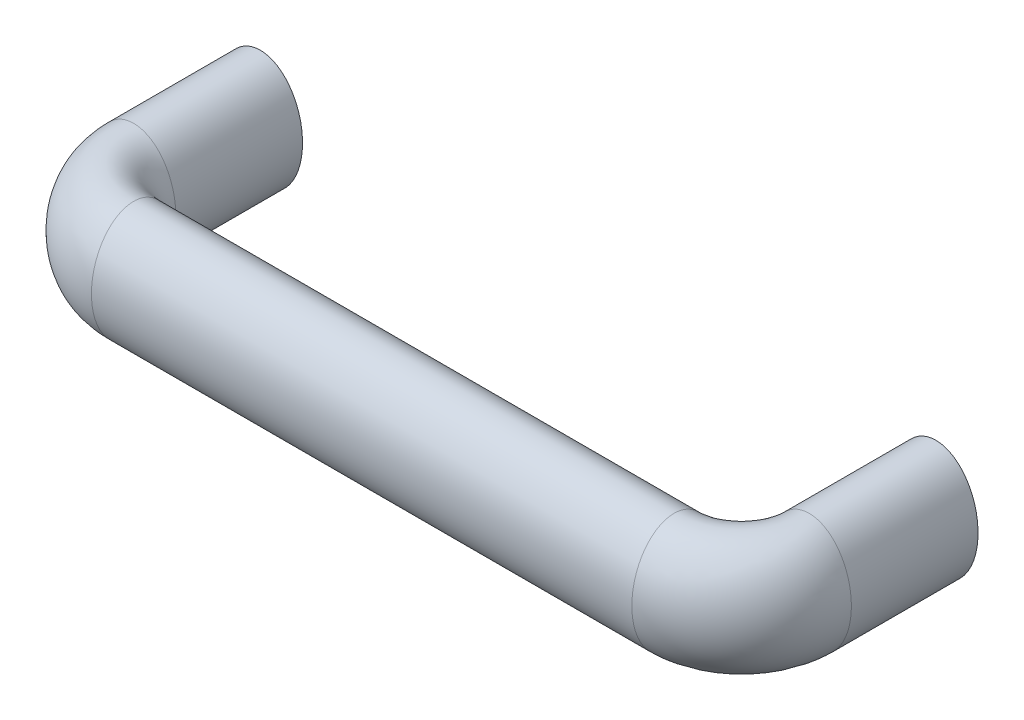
ISO-10303-21;
HEADER;
FILE_DESCRIPTION(('STEP AP214'),'2;1');
FILE_NAME('part.step','',(''),(''),'','','');
FILE_SCHEMA(('AUTOMOTIVE_DESIGN { 1 0 10303 214 1 1 1 1 }'));
ENDSEC;
DATA;
#1=APPLICATION_CONTEXT('core data for automotive mechanical design processes');
#2=APPLICATION_PROTOCOL_DEFINITION('international standard','automotive_design',2000,#1);
#3=PRODUCT_CONTEXT('',#1,'mechanical');
#4=PRODUCT('Part','Part','',(#3));
#5=PRODUCT_RELATED_PRODUCT_CATEGORY('part','',(#4));
#6=PRODUCT_DEFINITION_FORMATION('','',#4);
#7=PRODUCT_DEFINITION_CONTEXT('part definition',#1,'design');
#8=PRODUCT_DEFINITION('design','',#6,#7);
#9=PRODUCT_DEFINITION_SHAPE('','',#8);
#10=(LENGTH_UNIT() NAMED_UNIT(*) SI_UNIT(.MILLI.,.METRE.));
#11=(NAMED_UNIT(*) PLANE_ANGLE_UNIT() SI_UNIT($,.RADIAN.));
#12=(NAMED_UNIT(*) SI_UNIT($,.STERADIAN.) SOLID_ANGLE_UNIT());
#13=UNCERTAINTY_MEASURE_WITH_UNIT(LENGTH_MEASURE(1.E-05),#10,'distance_accuracy_value','');
#14=(GEOMETRIC_REPRESENTATION_CONTEXT(3) GLOBAL_UNCERTAINTY_ASSIGNED_CONTEXT((#13)) GLOBAL_UNIT_ASSIGNED_CONTEXT((#10,
#11,#12)) REPRESENTATION_CONTEXT('',''));
#15=CARTESIAN_POINT('',(0.,0.,0.));
#16=DIRECTION('',(0.,0.,1.));
#17=DIRECTION('',(1.,0.,0.));
#18=AXIS2_PLACEMENT_3D('',#15,#16,#17);
#19=CARTESIAN_POINT('',(0.,0.,0.));
#20=DIRECTION('',(0.,0.,1.));
#21=DIRECTION('',(0.,1.,0.));
#22=AXIS2_PLACEMENT_3D('',#19,#20,#21);
#23=PLANE('',#22);
#24=CARTESIAN_POINT('',(0.,0.,0.));
#25=DIRECTION('',(0.,0.,-1.));
#26=DIRECTION('',(0.,-1.,0.));
#27=AXIS2_PLACEMENT_3D('',#24,#25,#26);
#28=CIRCLE('',#27,4.);
#29=CARTESIAN_POINT('',(0.,-4.,0.));
#30=VERTEX_POINT('',#29);
#31=EDGE_CURVE('E34',#30,#30,#28,.T.);
#32=ORIENTED_EDGE('',*,*,#31,.F.);
#33=EDGE_LOOP('',(#32));
#34=FACE_BOUND('',#33,.T.);
#35=CARTESIAN_POINT('',(0.,-17.5,0.));
#36=CARTESIAN_POINT('',(0.266219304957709,-17.5000046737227,0.));
#37=CARTESIAN_POINT('',(0.532402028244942,-17.4880767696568,0.));
#38=CARTESIAN_POINT('',(1.06274099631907,-17.4406050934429,0.));
#39=CARTESIAN_POINT('',(1.32689664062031,-17.4050545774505,0.));
#40=CARTESIAN_POINT('',(1.85133678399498,-17.3109606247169,0.));
#41=CARTESIAN_POINT('',(2.11161707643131,-17.2523938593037,0.));
#42=CARTESIAN_POINT('',(2.6262198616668,-17.1133403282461,0.));
#43=CARTESIAN_POINT('',(2.88054266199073,-17.03285469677,0.));
#44=CARTESIAN_POINT('',(3.38025174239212,-16.8518441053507,0.));
#45=CARTESIAN_POINT('',(3.6256814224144,-16.7514385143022,0.));
#46=CARTESIAN_POINT('',(4.107939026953,-16.5318092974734,0.));
#47=CARTESIAN_POINT('',(4.34476703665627,-16.4125858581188,0.));
#48=CARTESIAN_POINT('',(4.80897252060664,-16.1568744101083,0.));
#49=CARTESIAN_POINT('',(5.03634734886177,-16.0203816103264,0.));
#50=CARTESIAN_POINT('',(5.48095416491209,-15.7317408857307,0.));
#51=CARTESIAN_POINT('',(5.69818393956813,-15.5795895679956,0.));
#52=CARTESIAN_POINT('',(6.21443828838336,-15.1917734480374,0.));
#53=CARTESIAN_POINT('',(6.50785457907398,-14.9486093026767,0.));
#54=CARTESIAN_POINT('',(7.07222244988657,-14.4374376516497,0.));
#55=CARTESIAN_POINT('',(7.34316475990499,-14.1694199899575,0.));
#56=CARTESIAN_POINT('',(7.86266638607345,-13.6121222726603,0.));
#57=CARTESIAN_POINT('',(8.11120548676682,-13.3228234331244,0.));
#58=CARTESIAN_POINT('',(8.58582374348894,-12.7265539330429,0.));
#59=CARTESIAN_POINT('',(8.81190775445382,-12.4195871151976,0.));
#60=CARTESIAN_POINT('',(9.31880023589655,-11.6787075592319,0.));
#61=CARTESIAN_POINT('',(9.59043901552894,-11.2385046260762,0.));
#62=CARTESIAN_POINT('',(10.0945400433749,-10.3370170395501,0.));
#63=CARTESIAN_POINT('',(10.3270439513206,-9.87575547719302,0.));
#64=CARTESIAN_POINT('',(10.7565038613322,-8.93245239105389,0.));
#65=CARTESIAN_POINT('',(10.9531517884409,-8.45027116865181,0.));
#66=CARTESIAN_POINT('',(11.309963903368,-7.47245511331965,0.));
#67=CARTESIAN_POINT('',(11.4701141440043,-6.97681521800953,0.));
#68=CARTESIAN_POINT('',(11.7553997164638,-5.97416905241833,0.));
#69=CARTESIAN_POINT('',(11.8804406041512,-5.46713601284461,0.));
#70=CARTESIAN_POINT('',(12.0958757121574,-4.44583839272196,0.));
#71=CARTESIAN_POINT('',(12.1862719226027,-3.93157422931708,0.));
#72=CARTESIAN_POINT('',(12.3458779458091,-2.80850524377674,0.));
#73=CARTESIAN_POINT('',(12.4086869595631,-2.19878424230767,0.));
#74=CARTESIAN_POINT('',(12.4882346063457,-0.976252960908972,0.));
#75=CARTESIAN_POINT('',(12.5049634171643,-0.363442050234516,0.));
#76=CARTESIAN_POINT('',(12.4925154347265,0.860494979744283,0.));
#77=CARTESIAN_POINT('',(12.4634306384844,1.47162201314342,0.));
#78=CARTESIAN_POINT('',(12.3592371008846,2.68973906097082,0.));
#79=CARTESIAN_POINT('',(12.284143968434,3.2967304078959,0.));
#80=CARTESIAN_POINT('',(12.0774335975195,4.56267651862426,0.));
#81=CARTESIAN_POINT('',(11.9409703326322,5.22084917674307,0.));
#82=CARTESIAN_POINT('',(11.6096051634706,6.52333970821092,0.));
#83=CARTESIAN_POINT('',(11.4146307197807,7.16763931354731,0.));
#84=CARTESIAN_POINT('',(11.0088033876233,8.30851938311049,0.));
#85=CARTESIAN_POINT('',(10.8088329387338,8.80897936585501,0.));
#86=CARTESIAN_POINT('',(10.3682804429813,9.79205670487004,0.));
#87=CARTESIAN_POINT('',(10.1276833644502,10.2746673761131,0.));
#88=CARTESIAN_POINT('',(9.60459148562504,11.2160088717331,0.));
#89=CARTESIAN_POINT('',(9.32214473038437,11.6747662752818,0.));
#90=CARTESIAN_POINT('',(8.71362701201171,12.5622599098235,0.));
#91=CARTESIAN_POINT('',(8.38758695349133,12.9910170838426,0.));
#92=CARTESIAN_POINT('',(7.82408634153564,13.6535957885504,0.));
#93=CARTESIAN_POINT('',(7.60044925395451,13.8992475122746,0.));
#94=CARTESIAN_POINT('',(7.13596644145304,14.3737534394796,0.));
#95=CARTESIAN_POINT('',(6.89512260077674,14.6026094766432,0.));
#96=CARTESIAN_POINT('',(6.39660168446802,15.040719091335,0.));
#97=CARTESIAN_POINT('',(6.13894166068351,15.2499920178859,0.));
#98=CARTESIAN_POINT('',(5.60704333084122,15.6463249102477,0.));
#99=CARTESIAN_POINT('',(5.33280775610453,15.8333885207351,0.));
#100=CARTESIAN_POINT('',(4.81459527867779,16.1538610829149,0.));
#101=CARTESIAN_POINT('',(4.57295293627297,16.2910480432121,0.));
#102=CARTESIAN_POINT('',(4.07957827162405,16.5458528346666,0.));
#103=CARTESIAN_POINT('',(3.82784793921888,16.663474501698,0.));
#104=CARTESIAN_POINT('',(3.31581871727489,16.8772072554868,0.));
#105=CARTESIAN_POINT('',(3.05553305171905,16.9733499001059,0.));
#106=CARTESIAN_POINT('',(2.52767781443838,17.1426639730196,0.));
#107=CARTESIAN_POINT('',(2.26011066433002,17.2158429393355,0.));
#108=CARTESIAN_POINT('',(1.66363004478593,17.3504780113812,0.));
#109=CARTESIAN_POINT('',(1.33344755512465,17.4064019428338,0.));
#110=CARTESIAN_POINT('',(0.668824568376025,17.4811628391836,0.));
#111=CARTESIAN_POINT('',(0.334383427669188,17.4999941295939,0.));
#112=CARTESIAN_POINT('',(-0.266219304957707,17.5000046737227,0.));
#113=CARTESIAN_POINT('',(-0.532402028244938,17.4880767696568,0.));
#114=CARTESIAN_POINT('',(-1.06274099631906,17.440605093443,0.));
#115=CARTESIAN_POINT('',(-1.32689664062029,17.4050545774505,0.));
#116=CARTESIAN_POINT('',(-1.85133678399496,17.3109606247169,0.));
#117=CARTESIAN_POINT('',(-2.11161707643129,17.2523938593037,0.));
#118=CARTESIAN_POINT('',(-2.62621986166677,17.1133403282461,0.));
#119=CARTESIAN_POINT('',(-2.88054266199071,17.03285469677,0.));
#120=CARTESIAN_POINT('',(-3.38025174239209,16.8518441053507,0.));
#121=CARTESIAN_POINT('',(-3.62568142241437,16.7514385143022,0.));
#122=CARTESIAN_POINT('',(-4.10793902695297,16.5318092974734,0.));
#123=CARTESIAN_POINT('',(-4.34476703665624,16.4125858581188,0.));
#124=CARTESIAN_POINT('',(-4.80897252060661,16.1568744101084,0.));
#125=CARTESIAN_POINT('',(-5.03634734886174,16.0203816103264,0.));
#126=CARTESIAN_POINT('',(-5.48095416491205,15.7317408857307,0.));
#127=CARTESIAN_POINT('',(-5.69818393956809,15.5795895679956,0.));
#128=CARTESIAN_POINT('',(-6.21443828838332,15.1917734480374,0.));
#129=CARTESIAN_POINT('',(-6.50785457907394,14.9486093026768,0.));
#130=CARTESIAN_POINT('',(-7.07222244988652,14.4374376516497,0.));
#131=CARTESIAN_POINT('',(-7.34316475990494,14.1694199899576,0.));
#132=CARTESIAN_POINT('',(-7.86266638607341,13.6121222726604,0.));
#133=CARTESIAN_POINT('',(-8.11120548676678,13.3228234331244,0.));
#134=CARTESIAN_POINT('',(-8.5858237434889,12.7265539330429,0.));
#135=CARTESIAN_POINT('',(-8.81190775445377,12.4195871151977,0.));
#136=CARTESIAN_POINT('',(-9.3188002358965,11.678707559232,0.));
#137=CARTESIAN_POINT('',(-9.5904390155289,11.2385046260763,0.));
#138=CARTESIAN_POINT('',(-10.0945400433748,10.3370170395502,0.));
#139=CARTESIAN_POINT('',(-10.3270439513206,9.87575547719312,0.));
#140=CARTESIAN_POINT('',(-10.7565038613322,8.932452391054,0.));
#141=CARTESIAN_POINT('',(-10.9531517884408,8.45027116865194,0.));
#142=CARTESIAN_POINT('',(-11.3099639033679,7.47245511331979,0.));
#143=CARTESIAN_POINT('',(-11.4701141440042,6.97681521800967,0.));
#144=CARTESIAN_POINT('',(-11.7553997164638,5.97416905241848,0.));
#145=CARTESIAN_POINT('',(-11.8804406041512,5.46713601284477,0.));
#146=CARTESIAN_POINT('',(-12.0958757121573,4.44583839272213,0.));
#147=CARTESIAN_POINT('',(-12.1862719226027,3.93157422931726,0.));
#148=CARTESIAN_POINT('',(-12.3458779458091,2.80850524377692,0.));
#149=CARTESIAN_POINT('',(-12.4086869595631,2.19878424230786,0.));
#150=CARTESIAN_POINT('',(-12.4882346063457,0.976252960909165,0.));
#151=CARTESIAN_POINT('',(-12.5049634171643,0.36344205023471,0.));
#152=CARTESIAN_POINT('',(-12.4925154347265,-0.860494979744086,0.));
#153=CARTESIAN_POINT('',(-12.4634306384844,-1.47162201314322,0.));
#154=CARTESIAN_POINT('',(-12.3592371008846,-2.68973906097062,0.));
#155=CARTESIAN_POINT('',(-12.284143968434,-3.2967304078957,0.));
#156=CARTESIAN_POINT('',(-12.0774335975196,-4.56267651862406,0.));
#157=CARTESIAN_POINT('',(-11.9409703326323,-5.22084917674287,0.));
#158=CARTESIAN_POINT('',(-11.6096051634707,-6.52333970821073,0.));
#159=CARTESIAN_POINT('',(-11.4146307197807,-7.16763931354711,0.));
#160=CARTESIAN_POINT('',(-11.0088033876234,-8.30851938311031,0.));
#161=CARTESIAN_POINT('',(-10.8088329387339,-8.80897936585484,0.));
#162=CARTESIAN_POINT('',(-10.3682804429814,-9.79205670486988,0.));
#163=CARTESIAN_POINT('',(-10.1276833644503,-10.274667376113,0.));
#164=CARTESIAN_POINT('',(-9.60459148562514,-11.2160088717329,0.));
#165=CARTESIAN_POINT('',(-9.32214473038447,-11.6747662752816,0.));
#166=CARTESIAN_POINT('',(-8.71362701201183,-12.5622599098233,0.));
#167=CARTESIAN_POINT('',(-8.38758695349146,-12.9910170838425,0.));
#168=CARTESIAN_POINT('',(-7.82408634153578,-13.6535957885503,0.));
#169=CARTESIAN_POINT('',(-7.60044925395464,-13.8992475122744,0.));
#170=CARTESIAN_POINT('',(-7.13596644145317,-14.3737534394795,0.));
#171=CARTESIAN_POINT('',(-6.89512260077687,-14.6026094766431,0.));
#172=CARTESIAN_POINT('',(-6.39660168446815,-15.0407190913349,0.));
#173=CARTESIAN_POINT('',(-6.13894166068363,-15.2499920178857,0.));
#174=CARTESIAN_POINT('',(-5.60704333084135,-15.6463249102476,0.));
#175=CARTESIAN_POINT('',(-5.33280775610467,-15.833388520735,0.));
#176=CARTESIAN_POINT('',(-4.81459527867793,-16.1538610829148,0.));
#177=CARTESIAN_POINT('',(-4.5729529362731,-16.291048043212,0.));
#178=CARTESIAN_POINT('',(-4.07957827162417,-16.5458528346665,0.));
#179=CARTESIAN_POINT('',(-3.82784793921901,-16.6634745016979,0.));
#180=CARTESIAN_POINT('',(-3.31581871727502,-16.8772072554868,0.));
#181=CARTESIAN_POINT('',(-3.05553305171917,-16.9733499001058,0.));
#182=CARTESIAN_POINT('',(-2.5276778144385,-17.1426639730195,0.));
#183=CARTESIAN_POINT('',(-2.26011066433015,-17.2158429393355,0.));
#184=CARTESIAN_POINT('',(-1.66363004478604,-17.3504780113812,0.));
#185=CARTESIAN_POINT('',(-1.33344755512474,-17.4064019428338,0.));
#186=CARTESIAN_POINT('',(-0.668824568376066,-17.4811628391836,0.));
#187=CARTESIAN_POINT('',(-0.334383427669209,-17.4999941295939,0.));
#188=CARTESIAN_POINT('',(0.,-17.5,0.));
#189=B_SPLINE_CURVE_WITH_KNOTS('',3,(#35,#36,#37,#38,#39,#40,#41,#42,#43,#44,#45,#46,#47,#48,
#49,#50,#51,#52,#53,#54,#55,#56,#57,#58,#59,#60,#61,#62,#63,#64,#65,#66,#67,#68,#69,#70,#71,#72,
#73,#74,#75,#76,#77,#78,#79,#80,#81,#82,#83,#84,#85,#86,#87,#88,#89,#90,#91,#92,#93,#94,#95,#96,
#97,#98,#99,#100,#101,#102,#103,#104,#105,#106,#107,#108,#109,#110,#111,#112,#113,#114,#115,
#116,#117,#118,#119,#120,#121,#122,#123,#124,#125,#126,#127,#128,#129,#130,#131,#132,#133,#134,
#135,#136,#137,#138,#139,#140,#141,#142,#143,#144,#145,#146,#147,#148,#149,#150,#151,#152,#153,
#154,#155,#156,#157,#158,#159,#160,#161,#162,#163,#164,#165,#166,#167,#168,#169,#170,#171,#172,
#173,#174,#175,#176,#177,#178,#179,#180,#181,#182,#183,#184,#185,#186,#187,#188),.UNSPECIFIED.,
.T.,.F.,(4,2,2,2,2,2,2,2,2,2,2,2,2,2,2,2,2,2,2,2,2,2,2,2,2,2,2,2,2,2,2,2,2,2,2,2,2,2,2,2,2,2,2,
2,2,2,2,2,2,2,2,2,2,2,2,2,2,2,2,2,2,2,2,2,2,2,2,2,2,2,2,2,2,2,2,2,4),(0.,0.798330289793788,
1.59688858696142,2.39625837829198,3.19558681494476,3.99026263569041,4.78493058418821,
5.57981948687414,6.37488099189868,7.51641419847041,8.65841594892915,9.80143807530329,
10.9442125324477,12.4937998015,14.0417269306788,15.6023843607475,17.1636371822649,
18.7290503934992,20.2943736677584,22.1313945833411,23.9688070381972,25.8025345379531,
27.6356402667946,29.6496133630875,31.6660936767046,33.2812632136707,34.8970316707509,
36.510959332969,38.1237488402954,39.1196119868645,40.1153662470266,41.1101260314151,
42.1047223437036,42.9375268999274,43.770167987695,44.6015775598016,45.4327139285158,
46.4352993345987,47.4380381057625,48.2363683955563,49.0349266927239,49.8342964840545,
50.6336249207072,51.4283007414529,52.2229686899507,53.0178575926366,53.8129190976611,
54.9544523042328,56.0964540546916,57.2394761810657,58.3822506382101,59.9318379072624,
61.4797650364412,63.0404224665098,64.6016752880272,66.1670884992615,67.7324117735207,
69.5694326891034,71.4068451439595,73.2405726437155,75.0736783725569,77.0876514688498,
79.1041317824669,80.719301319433,82.3350697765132,83.9489974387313,85.5617869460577,
86.5576500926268,87.5534043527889,88.5481641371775,89.542760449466,90.3755650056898,
91.2082060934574,92.0396156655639,92.8707520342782,93.8733374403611,94.876076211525),.UNSPECIFIED.);
#190=CARTESIAN_POINT('',(0.,-17.5,0.));
#191=VERTEX_POINT('',#190);
#192=EDGE_CURVE('E16',#191,#191,#189,.T.);
#193=ORIENTED_EDGE('',*,*,#192,.F.);
#194=EDGE_LOOP('',(#193));
#195=FACE_BOUND('',#194,.T.);
#196=ADVANCED_FACE('F12',(#34,#195),#23,.F.);
#197=CARTESIAN_POINT('',(200.,0.,0.));
#198=DIRECTION('',(0.,0.,1.));
#199=DIRECTION('',(0.,1.,0.));
#200=AXIS2_PLACEMENT_3D('',#197,#198,#199);
#201=PLANE('',#200);
#202=CARTESIAN_POINT('',(200.,0.,0.));
#203=DIRECTION('',(0.,0.,-1.));
#204=DIRECTION('',(0.,-1.,0.));
#205=AXIS2_PLACEMENT_3D('',#202,#203,#204);
#206=CIRCLE('',#205,4.);
#207=CARTESIAN_POINT('',(200.,-4.,0.));
#208=VERTEX_POINT('',#207);
#209=EDGE_CURVE('E147',#208,#208,#206,.T.);
#210=ORIENTED_EDGE('',*,*,#209,.F.);
#211=EDGE_LOOP('',(#210));
#212=FACE_BOUND('',#211,.T.);
#213=CARTESIAN_POINT('',(200.,-17.5,0.));
#214=CARTESIAN_POINT('',(199.733780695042,-17.5000046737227,0.));
#215=CARTESIAN_POINT('',(199.467597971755,-17.4880767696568,0.));
#216=CARTESIAN_POINT('',(198.937259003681,-17.440605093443,0.));
#217=CARTESIAN_POINT('',(198.67310335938,-17.4050545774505,0.));
#218=CARTESIAN_POINT('',(198.148663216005,-17.3109606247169,0.));
#219=CARTESIAN_POINT('',(197.888382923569,-17.2523938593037,0.));
#220=CARTESIAN_POINT('',(197.373780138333,-17.1133403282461,0.));
#221=CARTESIAN_POINT('',(197.11945733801,-17.03285469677,0.));
#222=CARTESIAN_POINT('',(196.619748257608,-16.8518441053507,0.));
#223=CARTESIAN_POINT('',(196.374318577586,-16.7514385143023,0.));
#224=CARTESIAN_POINT('',(195.892060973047,-16.5318092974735,0.));
#225=CARTESIAN_POINT('',(195.655232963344,-16.4125858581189,0.));
#226=CARTESIAN_POINT('',(195.191027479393,-16.1568744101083,0.));
#227=CARTESIAN_POINT('',(194.963652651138,-16.0203816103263,0.));
#228=CARTESIAN_POINT('',(194.519045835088,-15.7317408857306,0.));
#229=CARTESIAN_POINT('',(194.301816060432,-15.5795895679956,0.));
#230=CARTESIAN_POINT('',(193.785561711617,-15.1917734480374,0.));
#231=CARTESIAN_POINT('',(193.492145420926,-14.9486093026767,0.));
#232=CARTESIAN_POINT('',(192.927777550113,-14.4374376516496,0.));
#233=CARTESIAN_POINT('',(192.656835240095,-14.1694199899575,0.));
#234=CARTESIAN_POINT('',(192.137333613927,-13.6121222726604,0.));
#235=CARTESIAN_POINT('',(191.888794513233,-13.3228234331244,0.));
#236=CARTESIAN_POINT('',(191.414176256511,-12.7265539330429,0.));
#237=CARTESIAN_POINT('',(191.188092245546,-12.4195871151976,0.));
#238=CARTESIAN_POINT('',(190.681199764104,-11.6787075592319,0.));
#239=CARTESIAN_POINT('',(190.409560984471,-11.2385046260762,0.));
#240=CARTESIAN_POINT('',(189.905459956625,-10.3370170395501,0.));
#241=CARTESIAN_POINT('',(189.672956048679,-9.87575547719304,0.));
#242=CARTESIAN_POINT('',(189.243496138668,-8.93245239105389,0.));
#243=CARTESIAN_POINT('',(189.046848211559,-8.45027116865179,0.));
#244=CARTESIAN_POINT('',(188.690036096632,-7.47245511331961,0.));
#245=CARTESIAN_POINT('',(188.529885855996,-6.97681521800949,0.));
#246=CARTESIAN_POINT('',(188.244600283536,-5.97416905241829,0.));
#247=CARTESIAN_POINT('',(188.119559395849,-5.46713601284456,0.));
#248=CARTESIAN_POINT('',(187.904124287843,-4.44583839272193,0.));
#249=CARTESIAN_POINT('',(187.813728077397,-3.93157422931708,0.));
#250=CARTESIAN_POINT('',(187.654122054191,-2.80850524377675,0.));
#251=CARTESIAN_POINT('',(187.591313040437,-2.19878424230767,0.));
#252=CARTESIAN_POINT('',(187.511765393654,-0.976252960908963,0.));
#253=CARTESIAN_POINT('',(187.495036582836,-0.363442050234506,0.));
#254=CARTESIAN_POINT('',(187.507484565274,0.860494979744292,0.));
#255=CARTESIAN_POINT('',(187.536569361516,1.47162201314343,0.));
#256=CARTESIAN_POINT('',(187.640762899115,2.68973906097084,0.));
#257=CARTESIAN_POINT('',(187.715856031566,3.29673040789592,0.));
#258=CARTESIAN_POINT('',(187.92256640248,4.56267651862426,0.));
#259=CARTESIAN_POINT('',(188.059029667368,5.22084917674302,0.));
#260=CARTESIAN_POINT('',(188.390394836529,6.52333970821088,0.));
#261=CARTESIAN_POINT('',(188.585369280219,7.1676393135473,0.));
#262=CARTESIAN_POINT('',(188.991196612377,8.30851938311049,0.));
#263=CARTESIAN_POINT('',(189.191167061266,8.808979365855,0.));
#264=CARTESIAN_POINT('',(189.631719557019,9.79205670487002,0.));
#265=CARTESIAN_POINT('',(189.87231663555,10.2746673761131,0.));
#266=CARTESIAN_POINT('',(190.395408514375,11.2160088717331,0.));
#267=CARTESIAN_POINT('',(190.677855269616,11.6747662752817,0.));
#268=CARTESIAN_POINT('',(191.286372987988,12.5622599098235,0.));
#269=CARTESIAN_POINT('',(191.612413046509,12.9910170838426,0.));
#270=CARTESIAN_POINT('',(192.175913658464,13.6535957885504,0.));
#271=CARTESIAN_POINT('',(192.399550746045,13.8992475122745,0.));
#272=CARTESIAN_POINT('',(192.864033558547,14.3737534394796,0.));
#273=CARTESIAN_POINT('',(193.104877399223,14.6026094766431,0.));
#274=CARTESIAN_POINT('',(193.603398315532,15.040719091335,0.));
#275=CARTESIAN_POINT('',(193.861058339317,15.2499920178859,0.));
#276=CARTESIAN_POINT('',(194.392956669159,15.6463249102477,0.));
#277=CARTESIAN_POINT('',(194.667192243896,15.8333885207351,0.));
#278=CARTESIAN_POINT('',(195.185404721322,16.1538610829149,0.));
#279=CARTESIAN_POINT('',(195.427047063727,16.2910480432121,0.));
#280=CARTESIAN_POINT('',(195.920421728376,16.5458528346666,0.));
#281=CARTESIAN_POINT('',(196.172152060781,16.6634745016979,0.));
#282=CARTESIAN_POINT('',(196.684181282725,16.8772072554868,0.));
#283=CARTESIAN_POINT('',(196.944466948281,16.9733499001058,0.));
#284=CARTESIAN_POINT('',(197.472322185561,17.1426639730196,0.));
#285=CARTESIAN_POINT('',(197.73988933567,17.2158429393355,0.));
#286=CARTESIAN_POINT('',(198.336369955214,17.3504780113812,0.));
#287=CARTESIAN_POINT('',(198.666552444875,17.4064019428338,0.));
#288=CARTESIAN_POINT('',(199.331175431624,17.4811628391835,0.));
#289=CARTESIAN_POINT('',(199.665616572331,17.4999941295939,0.));
#290=CARTESIAN_POINT('',(200.266219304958,17.5000046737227,0.));
#291=CARTESIAN_POINT('',(200.532402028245,17.4880767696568,0.));
#292=CARTESIAN_POINT('',(201.062740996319,17.440605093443,0.));
#293=CARTESIAN_POINT('',(201.32689664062,17.4050545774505,0.));
#294=CARTESIAN_POINT('',(201.851336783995,17.3109606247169,0.));
#295=CARTESIAN_POINT('',(202.111617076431,17.2523938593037,0.));
#296=CARTESIAN_POINT('',(202.626219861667,17.1133403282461,0.));
#297=CARTESIAN_POINT('',(202.880542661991,17.03285469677,0.));
#298=CARTESIAN_POINT('',(203.380251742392,16.8518441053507,0.));
#299=CARTESIAN_POINT('',(203.625681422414,16.7514385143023,0.));
#300=CARTESIAN_POINT('',(204.107939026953,16.5318092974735,0.));
#301=CARTESIAN_POINT('',(204.344767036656,16.4125858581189,0.));
#302=CARTESIAN_POINT('',(204.808972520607,16.1568744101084,0.));
#303=CARTESIAN_POINT('',(205.036347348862,16.0203816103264,0.));
#304=CARTESIAN_POINT('',(205.480954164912,15.7317408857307,0.));
#305=CARTESIAN_POINT('',(205.698183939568,15.5795895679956,0.));
#306=CARTESIAN_POINT('',(206.214438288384,15.1917734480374,0.));
#307=CARTESIAN_POINT('',(206.507854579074,14.9486093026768,0.));
#308=CARTESIAN_POINT('',(207.072222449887,14.4374376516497,0.));
#309=CARTESIAN_POINT('',(207.343164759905,14.1694199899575,0.));
#310=CARTESIAN_POINT('',(207.862666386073,13.6121222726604,0.));
#311=CARTESIAN_POINT('',(208.111205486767,13.3228234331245,0.));
#312=CARTESIAN_POINT('',(208.585823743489,12.726553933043,0.));
#313=CARTESIAN_POINT('',(208.811907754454,12.4195871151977,0.));
#314=CARTESIAN_POINT('',(209.318800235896,11.678707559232,0.));
#315=CARTESIAN_POINT('',(209.590439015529,11.2385046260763,0.));
#316=CARTESIAN_POINT('',(210.094540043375,10.3370170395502,0.));
#317=CARTESIAN_POINT('',(210.327043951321,9.87575547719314,0.));
#318=CARTESIAN_POINT('',(210.756503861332,8.932452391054,0.));
#319=CARTESIAN_POINT('',(210.953151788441,8.45027116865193,0.));
#320=CARTESIAN_POINT('',(211.309963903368,7.47245511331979,0.));
#321=CARTESIAN_POINT('',(211.470114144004,6.97681521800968,0.));
#322=CARTESIAN_POINT('',(211.755399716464,5.97416905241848,0.));
#323=CARTESIAN_POINT('',(211.880440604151,5.46713601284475,0.));
#324=CARTESIAN_POINT('',(212.095875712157,4.44583839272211,0.));
#325=CARTESIAN_POINT('',(212.186271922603,3.93157422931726,0.));
#326=CARTESIAN_POINT('',(212.345877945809,2.80850524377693,0.));
#327=CARTESIAN_POINT('',(212.408686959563,2.19878424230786,0.));
#328=CARTESIAN_POINT('',(212.488234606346,0.976252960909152,0.));
#329=CARTESIAN_POINT('',(212.504963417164,0.3634420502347,0.));
#330=CARTESIAN_POINT('',(212.492515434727,-0.860494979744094,0.));
#331=CARTESIAN_POINT('',(212.463430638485,-1.47162201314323,0.));
#332=CARTESIAN_POINT('',(212.359237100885,-2.68973906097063,0.));
#333=CARTESIAN_POINT('',(212.284143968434,-3.2967304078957,0.));
#334=CARTESIAN_POINT('',(212.07743359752,-4.56267651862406,0.));
#335=CARTESIAN_POINT('',(211.940970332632,-5.22084917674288,0.));
#336=CARTESIAN_POINT('',(211.609605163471,-6.52333970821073,0.));
#337=CARTESIAN_POINT('',(211.414630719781,-7.16763931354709,0.));
#338=CARTESIAN_POINT('',(211.008803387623,-8.30851938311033,0.));
#339=CARTESIAN_POINT('',(210.808832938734,-8.80897936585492,0.));
#340=CARTESIAN_POINT('',(210.368280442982,-9.79205670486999,0.));
#341=CARTESIAN_POINT('',(210.12768336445,-10.274667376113,0.));
#342=CARTESIAN_POINT('',(209.604591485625,-11.216008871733,0.));
#343=CARTESIAN_POINT('',(209.322144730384,-11.6747662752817,0.));
#344=CARTESIAN_POINT('',(208.713627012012,-12.5622599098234,0.));
#345=CARTESIAN_POINT('',(208.387586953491,-12.9910170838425,0.));
#346=CARTESIAN_POINT('',(207.824086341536,-13.6535957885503,0.));
#347=CARTESIAN_POINT('',(207.600449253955,-13.8992475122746,0.));
#348=CARTESIAN_POINT('',(207.135966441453,-14.3737534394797,0.));
#349=CARTESIAN_POINT('',(206.895122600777,-14.6026094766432,0.));
#350=CARTESIAN_POINT('',(206.396601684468,-15.040719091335,0.));
#351=CARTESIAN_POINT('',(206.138941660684,-15.2499920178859,0.));
#352=CARTESIAN_POINT('',(205.607043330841,-15.6463249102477,0.));
#353=CARTESIAN_POINT('',(205.332807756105,-15.833388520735,0.));
#354=CARTESIAN_POINT('',(204.814595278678,-16.1538610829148,0.));
#355=CARTESIAN_POINT('',(204.572952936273,-16.2910480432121,0.));
#356=CARTESIAN_POINT('',(204.079578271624,-16.5458528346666,0.));
#357=CARTESIAN_POINT('',(203.827847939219,-16.663474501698,0.));
#358=CARTESIAN_POINT('',(203.315818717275,-16.8772072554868,0.));
#359=CARTESIAN_POINT('',(203.055533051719,-16.9733499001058,0.));
#360=CARTESIAN_POINT('',(202.527677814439,-17.1426639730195,0.));
#361=CARTESIAN_POINT('',(202.26011066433,-17.2158429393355,0.));
#362=CARTESIAN_POINT('',(201.663630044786,-17.3504780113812,0.));
#363=CARTESIAN_POINT('',(201.333447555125,-17.4064019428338,0.));
#364=CARTESIAN_POINT('',(200.668824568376,-17.4811628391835,0.));
#365=CARTESIAN_POINT('',(200.334383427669,-17.4999941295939,0.));
#366=CARTESIAN_POINT('',(200.,-17.5,0.));
#367=B_SPLINE_CURVE_WITH_KNOTS('',3,(#213,#214,#215,#216,#217,#218,#219,#220,#221,#222,#223,
#224,#225,#226,#227,#228,#229,#230,#231,#232,#233,#234,#235,#236,#237,#238,#239,#240,#241,#242,
#243,#244,#245,#246,#247,#248,#249,#250,#251,#252,#253,#254,#255,#256,#257,#258,#259,#260,#261,
#262,#263,#264,#265,#266,#267,#268,#269,#270,#271,#272,#273,#274,#275,#276,#277,#278,#279,#280,
#281,#282,#283,#284,#285,#286,#287,#288,#289,#290,#291,#292,#293,#294,#295,#296,#297,#298,#299,
#300,#301,#302,#303,#304,#305,#306,#307,#308,#309,#310,#311,#312,#313,#314,#315,#316,#317,#318,
#319,#320,#321,#322,#323,#324,#325,#326,#327,#328,#329,#330,#331,#332,#333,#334,#335,#336,#337,
#338,#339,#340,#341,#342,#343,#344,#345,#346,#347,#348,#349,#350,#351,#352,#353,#354,#355,#356,
#357,#358,#359,#360,#361,#362,#363,#364,#365,#366),.UNSPECIFIED.,.T.,.F.,(4,2,2,2,2,2,2,2,2,2,2,
2,2,2,2,2,2,2,2,2,2,2,2,2,2,2,2,2,2,2,2,2,2,2,2,2,2,2,2,2,2,2,2,2,2,2,2,2,2,2,2,2,2,2,2,2,2,2,2,
2,2,2,2,2,2,2,2,2,2,2,2,2,2,2,2,2,4),(0.,0.798330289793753,1.59688858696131,2.39625837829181,
3.19558681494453,3.99026263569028,4.78493058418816,5.57981948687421,6.37488099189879,
7.51641419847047,8.65841594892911,9.80143807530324,10.9442125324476,12.4937998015,
14.0417269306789,15.6023843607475,17.1636371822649,18.7290503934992,20.2943736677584,
22.1313945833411,23.9688070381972,25.8025345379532,27.6356402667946,29.6496133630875,
31.6660936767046,33.2812632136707,34.8970316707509,36.5109593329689,38.1237488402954,
39.1196119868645,40.1153662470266,41.1101260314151,42.1047223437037,42.9375268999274,
43.770167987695,44.6015775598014,45.4327139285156,46.4352993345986,47.4380381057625,
48.2363683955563,49.0349266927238,49.8342964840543,50.633624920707,51.4283007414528,
52.2229686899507,53.0178575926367,53.8129190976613,54.954452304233,56.0964540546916,
57.2394761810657,58.3822506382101,59.9318379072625,61.4797650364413,63.0404224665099,
64.6016752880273,66.1670884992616,67.7324117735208,69.5694326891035,71.4068451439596,
73.2405726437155,75.073678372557,77.0876514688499,79.104131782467,80.7193013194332,
82.3350697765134,83.9489974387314,85.5617869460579,86.5576500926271,87.5534043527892,
88.5481641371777,89.5427604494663,90.37556500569,91.2082060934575,92.039615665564,
92.8707520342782,93.8733374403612,94.8760762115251),.UNSPECIFIED.);
#368=CARTESIAN_POINT('',(200.,-17.5,0.));
#369=VERTEX_POINT('',#368);
#370=EDGE_CURVE('E55',#369,#369,#367,.T.);
#371=ORIENTED_EDGE('',*,*,#370,.T.);
#372=EDGE_LOOP('',(#371));
#373=FACE_BOUND('',#372,.T.);
#374=ADVANCED_FACE('F67',(#212,#373),#201,.F.);
#375=CARTESIAN_POINT('',(0.,-17.5,37.5));
#376=CARTESIAN_POINT('',(0.,-17.5,0.));
#377=CARTESIAN_POINT('',(-25.,-17.5,37.5));
#378=CARTESIAN_POINT('',(-25.,-17.5,0.));
#379=CARTESIAN_POINT('',(-25.,17.5,37.5));
#380=CARTESIAN_POINT('',(-25.,17.5,0.));
#381=CARTESIAN_POINT('',(0.,17.5,37.5));
#382=CARTESIAN_POINT('',(0.,17.5,0.));
#383=CARTESIAN_POINT('',(25.,17.5,37.5));
#384=CARTESIAN_POINT('',(25.,17.5,0.));
#385=CARTESIAN_POINT('',(25.,-17.5,37.5));
#386=CARTESIAN_POINT('',(25.,-17.5,0.));
#387=CARTESIAN_POINT('',(0.,-17.5,37.5));
#388=CARTESIAN_POINT('',(0.,-17.5,0.));
#389=(BOUNDED_SURFACE() B_SPLINE_SURFACE(3,1,((#375,#376),(#377,#378),(#379,#380),(#381,#382),
(#383,#384),(#385,#386),(#387,#388)),.UNSPECIFIED.,.T.,.F.,.F.) B_SPLINE_SURFACE_WITH_KNOTS((4,
3,4),(2,2),(0.,0.5,1.),(0.,1.),
.UNSPECIFIED.) GEOMETRIC_REPRESENTATION_ITEM() RATIONAL_B_SPLINE_SURFACE(((1.,1.),
(0.333333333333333,0.333333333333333),(0.333333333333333,0.333333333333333),(1.,1.),
(0.333333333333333,0.333333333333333),(0.333333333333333,0.333333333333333),(1.,1.))) REPRESENTATION_ITEM('') SURFACE());
#390=CARTESIAN_POINT('',(0.,-17.5,37.5));
#391=CARTESIAN_POINT('',(-25.,-17.5,37.5));
#392=CARTESIAN_POINT('',(-25.,17.5,37.5));
#393=CARTESIAN_POINT('',(0.,17.5,37.5));
#394=CARTESIAN_POINT('',(25.,17.5,37.5));
#395=CARTESIAN_POINT('',(25.,-17.5,37.5));
#396=CARTESIAN_POINT('',(0.,-17.5,37.5));
#397=(BOUNDED_CURVE() B_SPLINE_CURVE(3,(#390,#391,#392,#393,#394,#395,#396),.UNSPECIFIED.,.T.,
.F.) B_SPLINE_CURVE_WITH_KNOTS((4,3,4),(0.,0.5,1.),
.UNSPECIFIED.) CURVE() GEOMETRIC_REPRESENTATION_ITEM() RATIONAL_B_SPLINE_CURVE((1.,
0.333333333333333,0.333333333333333,1.,0.333333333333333,0.333333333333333,1.)) REPRESENTATION_ITEM(''));
#398=CARTESIAN_POINT('',(0.,-17.5,37.5));
#399=VERTEX_POINT('',#398);
#400=EDGE_CURVE('E49',#399,#399,#397,.T.);
#401=ORIENTED_EDGE('',*,*,#192,.T.);
#402=EDGE_LOOP('',(#401));
#403=FACE_BOUND('',#402,.T.);
#404=ORIENTED_EDGE('',*,*,#400,.T.);
#405=EDGE_LOOP('',(#404));
#406=FACE_BOUND('',#405,.T.);
#407=ADVANCED_FACE('F76',(#403,#406),#389,.T.);
#408=CARTESIAN_POINT('',(200.,-17.5,37.5));
#409=CARTESIAN_POINT('',(200.,-17.5,0.));
#410=CARTESIAN_POINT('',(225.,-17.5,37.5));
#411=CARTESIAN_POINT('',(225.,-17.5,0.));
#412=CARTESIAN_POINT('',(225.,17.5,37.5));
#413=CARTESIAN_POINT('',(225.,17.5,0.));
#414=CARTESIAN_POINT('',(200.,17.5,37.5));
#415=CARTESIAN_POINT('',(200.,17.5,0.));
#416=CARTESIAN_POINT('',(175.,17.5,37.5));
#417=CARTESIAN_POINT('',(175.,17.5,0.));
#418=CARTESIAN_POINT('',(175.,-17.5,37.5));
#419=CARTESIAN_POINT('',(175.,-17.5,0.));
#420=CARTESIAN_POINT('',(200.,-17.5,37.5));
#421=CARTESIAN_POINT('',(200.,-17.5,0.));
#422=(BOUNDED_SURFACE() B_SPLINE_SURFACE(3,1,((#408,#409),(#410,#411),(#412,#413),(#414,#415),
(#416,#417),(#418,#419),(#420,#421)),.UNSPECIFIED.,.T.,.F.,.F.) B_SPLINE_SURFACE_WITH_KNOTS((4,
3,4),(2,2),(0.,0.5,1.),(0.,1.),
.UNSPECIFIED.) GEOMETRIC_REPRESENTATION_ITEM() RATIONAL_B_SPLINE_SURFACE(((1.,1.),
(0.333333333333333,0.333333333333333),(0.333333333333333,0.333333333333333),(1.,1.),
(0.333333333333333,0.333333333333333),(0.333333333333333,0.333333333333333),(1.,1.))) REPRESENTATION_ITEM('') SURFACE());
#423=CARTESIAN_POINT('',(200.,-17.5,37.5));
#424=CARTESIAN_POINT('',(225.,-17.5,37.5));
#425=CARTESIAN_POINT('',(225.,17.5,37.5));
#426=CARTESIAN_POINT('',(200.,17.5,37.5));
#427=CARTESIAN_POINT('',(175.,17.5,37.5));
#428=CARTESIAN_POINT('',(175.,-17.5,37.5));
#429=CARTESIAN_POINT('',(200.,-17.5,37.5));
#430=(BOUNDED_CURVE() B_SPLINE_CURVE(3,(#423,#424,#425,#426,#427,#428,#429),.UNSPECIFIED.,.T.,
.F.) B_SPLINE_CURVE_WITH_KNOTS((4,3,4),(0.,0.5,1.),
.UNSPECIFIED.) CURVE() GEOMETRIC_REPRESENTATION_ITEM() RATIONAL_B_SPLINE_CURVE((1.,
0.333333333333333,0.333333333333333,1.,0.333333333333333,0.333333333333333,1.)) REPRESENTATION_ITEM(''));
#431=CARTESIAN_POINT('',(200.,-17.5,37.5));
#432=VERTEX_POINT('',#431);
#433=EDGE_CURVE('E29',#432,#432,#430,.T.);
#434=ORIENTED_EDGE('',*,*,#433,.F.);
#435=EDGE_LOOP('',(#434));
#436=FACE_BOUND('',#435,.T.);
#437=ORIENTED_EDGE('',*,*,#370,.F.);
#438=EDGE_LOOP('',(#437));
#439=FACE_BOUND('',#438,.T.);
#440=ADVANCED_FACE('F69',(#436,#439),#422,.F.);
#441=CARTESIAN_POINT('',(0.,-17.5,37.5));
#442=CARTESIAN_POINT('',(0.,-17.5,49.2157287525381));
#443=CARTESIAN_POINT('',(8.28427124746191,-17.5,57.5));
#444=CARTESIAN_POINT('',(20.,-17.5,57.5));
#445=CARTESIAN_POINT('',(-25.,-17.5,37.5));
#446=CARTESIAN_POINT('',(-25.,-17.5,63.8603896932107));
#447=CARTESIAN_POINT('',(-6.360389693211,-17.5,82.5));
#448=CARTESIAN_POINT('',(20.,-17.5,82.5000000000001));
#449=CARTESIAN_POINT('',(-25.,17.5,37.5));
#450=CARTESIAN_POINT('',(-25.,17.5,63.8603896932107));
#451=CARTESIAN_POINT('',(-6.360389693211,17.5,82.5));
#452=CARTESIAN_POINT('',(20.,17.5,82.5000000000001));
#453=CARTESIAN_POINT('',(0.,17.5,37.5));
#454=CARTESIAN_POINT('',(0.,17.5,49.2157287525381));
#455=CARTESIAN_POINT('',(8.28427124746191,17.5,57.5));
#456=CARTESIAN_POINT('',(20.,17.5,57.5));
#457=CARTESIAN_POINT('',(25.,17.5,37.5));
#458=CARTESIAN_POINT('',(25.,17.5,34.5710678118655));
#459=CARTESIAN_POINT('',(22.9289321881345,17.5,32.5));
#460=CARTESIAN_POINT('',(20.,17.5,32.5));
#461=CARTESIAN_POINT('',(25.,-17.5,37.5));
#462=CARTESIAN_POINT('',(25.,-17.5,34.5710678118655));
#463=CARTESIAN_POINT('',(22.9289321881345,-17.5,32.5));
#464=CARTESIAN_POINT('',(20.,-17.5,32.5));
#465=CARTESIAN_POINT('',(0.,-17.5,37.5));
#466=CARTESIAN_POINT('',(0.,-17.5,49.2157287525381));
#467=CARTESIAN_POINT('',(8.28427124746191,-17.5,57.5));
#468=CARTESIAN_POINT('',(20.,-17.5,57.5));
#469=(BOUNDED_SURFACE() B_SPLINE_SURFACE(3,3,((#441,#442,#443,#444),(#445,#446,#447,#448),(#449,
#450,#451,#452),(#453,#454,#455,#456),(#457,#458,#459,#460),(#461,#462,#463,#464),(#465,#466,
#467,#468)),.UNSPECIFIED.,.T.,.F.,.F.) B_SPLINE_SURFACE_WITH_KNOTS((4,3,4),(4,4),(0.,0.5,1.),
(0.,1.),.UNSPECIFIED.) GEOMETRIC_REPRESENTATION_ITEM() RATIONAL_B_SPLINE_SURFACE(((1.,
0.804737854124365,0.804737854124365,1.),(0.333333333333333,0.268245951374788,0.268245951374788,
0.333333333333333),(0.333333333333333,0.268245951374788,0.268245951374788,0.333333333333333),
(1.,0.804737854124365,0.804737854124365,1.),(0.333333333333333,0.268245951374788,
0.268245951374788,0.333333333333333),(0.333333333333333,0.268245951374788,0.268245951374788,
0.333333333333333),(1.,0.804737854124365,0.804737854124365,1.))) REPRESENTATION_ITEM('') SURFACE());
#470=CARTESIAN_POINT('',(20.,-17.5,57.5));
#471=CARTESIAN_POINT('',(20.,-17.5,82.5000000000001));
#472=CARTESIAN_POINT('',(20.,17.5,82.5000000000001));
#473=CARTESIAN_POINT('',(20.,17.5,57.5));
#474=CARTESIAN_POINT('',(20.,17.5,32.5));
#475=CARTESIAN_POINT('',(20.,-17.5,32.5));
#476=CARTESIAN_POINT('',(20.,-17.5,57.5));
#477=(BOUNDED_CURVE() B_SPLINE_CURVE(3,(#470,#471,#472,#473,#474,#475,#476),.UNSPECIFIED.,.T.,
.F.) B_SPLINE_CURVE_WITH_KNOTS((4,3,4),(0.,0.5,1.),
.UNSPECIFIED.) CURVE() GEOMETRIC_REPRESENTATION_ITEM() RATIONAL_B_SPLINE_CURVE((1.,
0.333333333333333,0.333333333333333,1.,0.333333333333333,0.333333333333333,1.)) REPRESENTATION_ITEM(''));
#478=CARTESIAN_POINT('',(20.,-17.5,57.5));
#479=VERTEX_POINT('',#478);
#480=EDGE_CURVE('E24',#479,#479,#477,.F.);
#481=ORIENTED_EDGE('',*,*,#400,.F.);
#482=EDGE_LOOP('',(#481));
#483=FACE_BOUND('',#482,.T.);
#484=ORIENTED_EDGE('',*,*,#480,.F.);
#485=EDGE_LOOP('',(#484));
#486=FACE_BOUND('',#485,.T.);
#487=ADVANCED_FACE('F75',(#483,#486),#469,.F.);
#488=CARTESIAN_POINT('',(200.,-17.5,37.5));
#489=CARTESIAN_POINT('',(200.,-17.5,49.2157287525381));
#490=CARTESIAN_POINT('',(191.715728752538,-17.5,57.5));
#491=CARTESIAN_POINT('',(180.,-17.5,57.5));
#492=CARTESIAN_POINT('',(225.,-17.5,37.5));
#493=CARTESIAN_POINT('',(225.,-17.5,63.8603896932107));
#494=CARTESIAN_POINT('',(206.360389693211,-17.5,82.5));
#495=CARTESIAN_POINT('',(180.,-17.5,82.5000000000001));
#496=CARTESIAN_POINT('',(225.,17.5,37.5));
#497=CARTESIAN_POINT('',(225.,17.5,63.8603896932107));
#498=CARTESIAN_POINT('',(206.360389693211,17.5,82.5));
#499=CARTESIAN_POINT('',(180.,17.5,82.5000000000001));
#500=CARTESIAN_POINT('',(200.,17.5,37.5));
#501=CARTESIAN_POINT('',(200.,17.5,49.2157287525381));
#502=CARTESIAN_POINT('',(191.715728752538,17.5,57.5));
#503=CARTESIAN_POINT('',(180.,17.5,57.5));
#504=CARTESIAN_POINT('',(175.,17.5,37.5));
#505=CARTESIAN_POINT('',(175.,17.5,34.5710678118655));
#506=CARTESIAN_POINT('',(177.071067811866,17.5,32.5));
#507=CARTESIAN_POINT('',(180.,17.5,32.5));
#508=CARTESIAN_POINT('',(175.,-17.5,37.5));
#509=CARTESIAN_POINT('',(175.,-17.5,34.5710678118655));
#510=CARTESIAN_POINT('',(177.071067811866,-17.5,32.5));
#511=CARTESIAN_POINT('',(180.,-17.5,32.5));
#512=CARTESIAN_POINT('',(200.,-17.5,37.5));
#513=CARTESIAN_POINT('',(200.,-17.5,49.2157287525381));
#514=CARTESIAN_POINT('',(191.715728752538,-17.5,57.5));
#515=CARTESIAN_POINT('',(180.,-17.5,57.5));
#516=(BOUNDED_SURFACE() B_SPLINE_SURFACE(3,3,((#488,#489,#490,#491),(#492,#493,#494,#495),(#496,
#497,#498,#499),(#500,#501,#502,#503),(#504,#505,#506,#507),(#508,#509,#510,#511),(#512,#513,
#514,#515)),.UNSPECIFIED.,.T.,.F.,.F.) B_SPLINE_SURFACE_WITH_KNOTS((4,3,4),(4,4),(0.,0.5,1.),
(0.,1.),.UNSPECIFIED.) GEOMETRIC_REPRESENTATION_ITEM() RATIONAL_B_SPLINE_SURFACE(((1.,
0.804737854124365,0.804737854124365,1.),(0.333333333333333,0.268245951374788,0.268245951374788,
0.333333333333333),(0.333333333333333,0.268245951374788,0.268245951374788,0.333333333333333),
(1.,0.804737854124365,0.804737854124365,1.),(0.333333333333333,0.268245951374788,
0.268245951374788,0.333333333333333),(0.333333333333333,0.268245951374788,0.268245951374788,
0.333333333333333),(1.,0.804737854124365,0.804737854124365,1.))) REPRESENTATION_ITEM('') SURFACE());
#517=CARTESIAN_POINT('',(180.,-17.5,57.5));
#518=CARTESIAN_POINT('',(180.,-17.5,82.5000000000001));
#519=CARTESIAN_POINT('',(180.,17.5,82.5000000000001));
#520=CARTESIAN_POINT('',(180.,17.5,57.5));
#521=CARTESIAN_POINT('',(180.,17.5,32.5));
#522=CARTESIAN_POINT('',(180.,-17.5,32.5));
#523=CARTESIAN_POINT('',(180.,-17.5,57.5));
#524=(BOUNDED_CURVE() B_SPLINE_CURVE(3,(#517,#518,#519,#520,#521,#522,#523),.UNSPECIFIED.,.T.,
.F.) B_SPLINE_CURVE_WITH_KNOTS((4,3,4),(0.,0.5,1.),
.UNSPECIFIED.) CURVE() GEOMETRIC_REPRESENTATION_ITEM() RATIONAL_B_SPLINE_CURVE((1.,
0.333333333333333,0.333333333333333,1.,0.333333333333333,0.333333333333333,1.)) REPRESENTATION_ITEM(''));
#525=CARTESIAN_POINT('',(180.,-17.5,57.5));
#526=VERTEX_POINT('',#525);
#527=EDGE_CURVE('E8',#526,#526,#524,.T.);
#528=ORIENTED_EDGE('',*,*,#527,.F.);
#529=EDGE_LOOP('',(#528));
#530=FACE_BOUND('',#529,.T.);
#531=ORIENTED_EDGE('',*,*,#433,.T.);
#532=EDGE_LOOP('',(#531));
#533=FACE_BOUND('',#532,.T.);
#534=ADVANCED_FACE('F106',(#530,#533),#516,.T.);
#535=CARTESIAN_POINT('',(180.,-17.5,57.5));
#536=CARTESIAN_POINT('',(20.,-17.5,57.5));
#537=CARTESIAN_POINT('',(180.,-17.5,82.5000000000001));
#538=CARTESIAN_POINT('',(20.,-17.5,82.5000000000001));
#539=CARTESIAN_POINT('',(180.,17.5,82.5000000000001));
#540=CARTESIAN_POINT('',(20.,17.5,82.5000000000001));
#541=CARTESIAN_POINT('',(180.,17.5,57.5));
#542=CARTESIAN_POINT('',(20.,17.5,57.5));
#543=CARTESIAN_POINT('',(180.,17.5,32.5));
#544=CARTESIAN_POINT('',(20.,17.5,32.5));
#545=CARTESIAN_POINT('',(180.,-17.5,32.5));
#546=CARTESIAN_POINT('',(20.,-17.5,32.5));
#547=CARTESIAN_POINT('',(180.,-17.5,57.5));
#548=CARTESIAN_POINT('',(20.,-17.5,57.5));
#549=(BOUNDED_SURFACE() B_SPLINE_SURFACE(3,1,((#535,#536),(#537,#538),(#539,#540),(#541,#542),
(#543,#544),(#545,#546),(#547,#548)),.UNSPECIFIED.,.T.,.F.,.F.) B_SPLINE_SURFACE_WITH_KNOTS((4,
3,4),(2,2),(0.,0.5,1.),(0.,1.),
.UNSPECIFIED.) GEOMETRIC_REPRESENTATION_ITEM() RATIONAL_B_SPLINE_SURFACE(((1.,1.),
(0.333333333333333,0.333333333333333),(0.333333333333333,0.333333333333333),(1.,1.),
(0.333333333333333,0.333333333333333),(0.333333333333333,0.333333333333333),(1.,1.))) REPRESENTATION_ITEM('') SURFACE());
#550=ORIENTED_EDGE('',*,*,#480,.T.);
#551=EDGE_LOOP('',(#550));
#552=FACE_BOUND('',#551,.T.);
#553=ORIENTED_EDGE('',*,*,#527,.T.);
#554=EDGE_LOOP('',(#553));
#555=FACE_BOUND('',#554,.T.);
#556=ADVANCED_FACE('F103',(#552,#555),#549,.T.);
#557=CARTESIAN_POINT('',(200.,0.,16.));
#558=DIRECTION('',(0.,0.,-1.));
#559=DIRECTION('',(0.,-1.,0.));
#560=AXIS2_PLACEMENT_3D('',#557,#558,#559);
#561=CYLINDRICAL_SURFACE('',#560,4.);
#562=CARTESIAN_POINT('',(200.,0.,16.));
#563=DIRECTION('',(0.,0.,-1.));
#564=DIRECTION('',(0.,-1.,0.));
#565=AXIS2_PLACEMENT_3D('',#562,#563,#564);
#566=CIRCLE('',#565,4.);
#567=CARTESIAN_POINT('',(200.,-4.,16.));
#568=VERTEX_POINT('',#567);
#569=EDGE_CURVE('E146',#568,#568,#566,.T.);
#570=ORIENTED_EDGE('',*,*,#569,.F.);
#571=EDGE_LOOP('',(#570));
#572=FACE_BOUND('',#571,.T.);
#573=ORIENTED_EDGE('',*,*,#209,.T.);
#574=EDGE_LOOP('',(#573));
#575=FACE_BOUND('',#574,.T.);
#576=ADVANCED_FACE('F105',(#572,#575),#561,.F.);
#577=CARTESIAN_POINT('',(200.,0.,16.));
#578=DIRECTION('',(0.,0.,-1.));
#579=DIRECTION('',(0.,-1.,0.));
#580=AXIS2_PLACEMENT_3D('',#577,#578,#579);
#581=PLANE('',#580);
#582=ORIENTED_EDGE('',*,*,#569,.T.);
#583=EDGE_LOOP('',(#582));
#584=FACE_BOUND('',#583,.T.);
#585=ADVANCED_FACE('F113',(#584),#581,.T.);
#586=CARTESIAN_POINT('',(0.,0.,16.));
#587=DIRECTION('',(0.,0.,-1.));
#588=DIRECTION('',(0.,-1.,0.));
#589=AXIS2_PLACEMENT_3D('',#586,#587,#588);
#590=CYLINDRICAL_SURFACE('',#589,4.);
#591=CARTESIAN_POINT('',(0.,0.,16.));
#592=DIRECTION('',(0.,0.,-1.));
#593=DIRECTION('',(0.,-1.,0.));
#594=AXIS2_PLACEMENT_3D('',#591,#592,#593);
#595=CIRCLE('',#594,4.);
#596=CARTESIAN_POINT('',(0.,-4.,16.));
#597=VERTEX_POINT('',#596);
#598=EDGE_CURVE('E150',#597,#597,#595,.T.);
#599=ORIENTED_EDGE('',*,*,#598,.F.);
#600=EDGE_LOOP('',(#599));
#601=FACE_BOUND('',#600,.T.);
#602=ORIENTED_EDGE('',*,*,#31,.T.);
#603=EDGE_LOOP('',(#602));
#604=FACE_BOUND('',#603,.T.);
#605=ADVANCED_FACE('F120',(#601,#604),#590,.F.);
#606=CARTESIAN_POINT('',(0.,0.,16.));
#607=DIRECTION('',(0.,0.,-1.));
#608=DIRECTION('',(0.,-1.,0.));
#609=AXIS2_PLACEMENT_3D('',#606,#607,#608);
#610=PLANE('',#609);
#611=ORIENTED_EDGE('',*,*,#598,.T.);
#612=EDGE_LOOP('',(#611));
#613=FACE_BOUND('',#612,.T.);
#614=ADVANCED_FACE('F135',(#613),#610,.T.);
#615=CLOSED_SHELL('',(#196,#374,#407,#440,#487,#534,#556,#576,#585,#605,#614));
#616=MANIFOLD_SOLID_BREP('B1',#615);
#617=ADVANCED_BREP_SHAPE_REPRESENTATION('',(#18,#616),#14);
#618=SHAPE_DEFINITION_REPRESENTATION(#9,#617);
ENDSEC;
END-ISO-10303-21;
